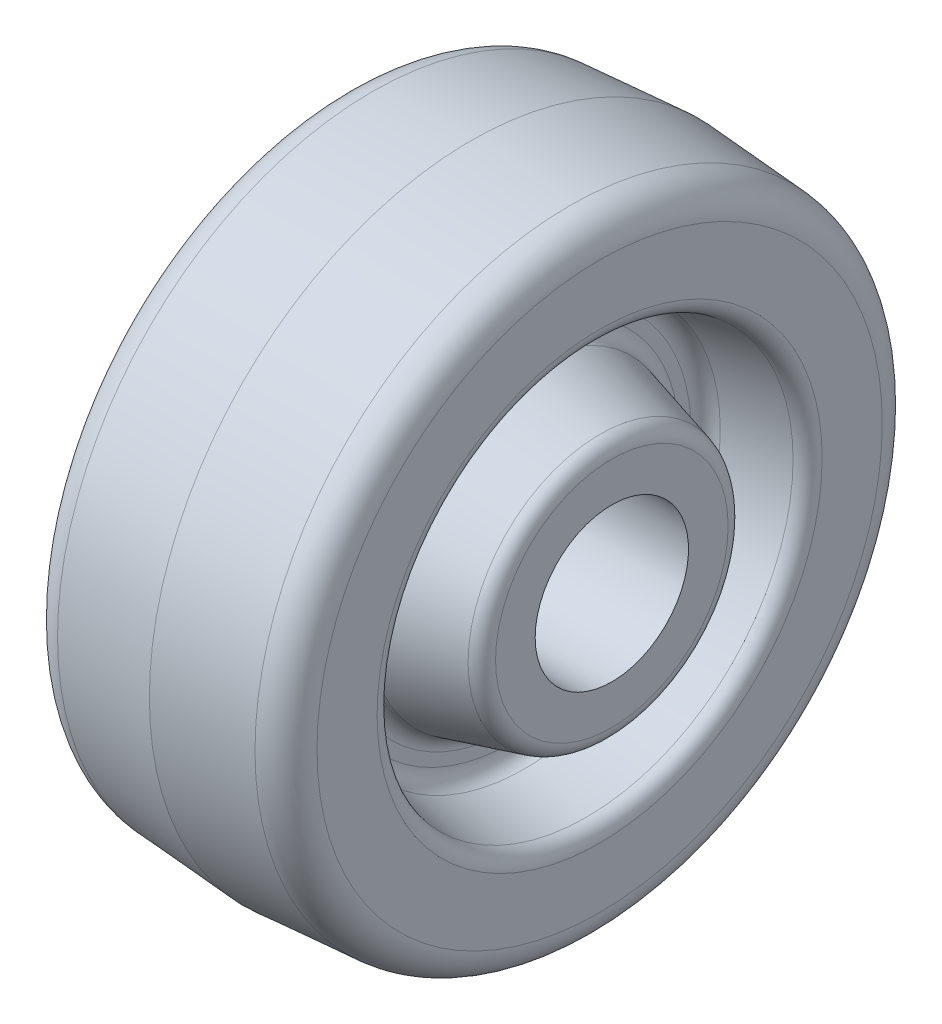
ISO-10303-21;
HEADER;
FILE_DESCRIPTION(('STEP AP214'),'2;1');
FILE_NAME('part.step','',(''),(''),'','','');
FILE_SCHEMA(('AUTOMOTIVE_DESIGN { 1 0 10303 214 1 1 1 1 }'));
ENDSEC;
DATA;
#1=APPLICATION_CONTEXT('core data for automotive mechanical design processes');
#2=APPLICATION_PROTOCOL_DEFINITION('international standard','automotive_design',2000,#1);
#3=PRODUCT_CONTEXT('',#1,'mechanical');
#4=PRODUCT('Part','Part','',(#3));
#5=PRODUCT_RELATED_PRODUCT_CATEGORY('part','',(#4));
#6=PRODUCT_DEFINITION_FORMATION('','',#4);
#7=PRODUCT_DEFINITION_CONTEXT('part definition',#1,'design');
#8=PRODUCT_DEFINITION('design','',#6,#7);
#9=PRODUCT_DEFINITION_SHAPE('','',#8);
#10=(LENGTH_UNIT() NAMED_UNIT(*) SI_UNIT(.MILLI.,.METRE.));
#11=(NAMED_UNIT(*) PLANE_ANGLE_UNIT() SI_UNIT($,.RADIAN.));
#12=(NAMED_UNIT(*) SI_UNIT($,.STERADIAN.) SOLID_ANGLE_UNIT());
#13=UNCERTAINTY_MEASURE_WITH_UNIT(LENGTH_MEASURE(1.E-05),#10,'distance_accuracy_value','');
#14=(GEOMETRIC_REPRESENTATION_CONTEXT(3) GLOBAL_UNCERTAINTY_ASSIGNED_CONTEXT((#13)) GLOBAL_UNIT_ASSIGNED_CONTEXT((#10,
#11,#12)) REPRESENTATION_CONTEXT('',''));
#15=CARTESIAN_POINT('',(0.,0.,0.));
#16=DIRECTION('',(0.,0.,1.));
#17=DIRECTION('',(1.,0.,0.));
#18=AXIS2_PLACEMENT_3D('',#15,#16,#17);
#19=CARTESIAN_POINT('',(0.,0.,0.));
#20=DIRECTION('',(1.,0.,0.));
#21=DIRECTION('',(0.,0.,-1.));
#22=AXIS2_PLACEMENT_3D('',#19,#20,#21);
#23=CONICAL_SURFACE('',#22,63.5,0.069813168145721);
#24=CARTESIAN_POINT('',(-19.4929535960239,0.,0.));
#25=DIRECTION('',(-1.,0.,0.));
#26=DIRECTION('',(0.,0.,1.));
#27=AXIS2_PLACEMENT_3D('',#24,#25,#26);
#28=CIRCLE('',#27,62.136919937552);
#29=CARTESIAN_POINT('',(-19.4929535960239,0.,62.136919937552));
#30=VERTEX_POINT('',#29);
#31=EDGE_CURVE('E433',#30,#30,#28,.T.);
#32=ORIENTED_EDGE('',*,*,#31,.F.);
#33=EDGE_LOOP('',(#32));
#34=FACE_BOUND('',#33,.T.);
#35=CARTESIAN_POINT('',(0.,0.,0.));
#36=DIRECTION('',(-1.,0.,0.));
#37=DIRECTION('',(0.,0.,1.));
#38=AXIS2_PLACEMENT_3D('',#35,#36,#37);
#39=CIRCLE('',#38,63.5);
#40=CARTESIAN_POINT('',(0.,0.,63.5));
#41=VERTEX_POINT('',#40);
#42=EDGE_CURVE('E10',#41,#41,#39,.T.);
#43=ORIENTED_EDGE('',*,*,#42,.T.);
#44=EDGE_LOOP('',(#43));
#45=FACE_BOUND('',#44,.T.);
#46=ADVANCED_FACE('F360',(#34,#45),#23,.T.);
#47=CARTESIAN_POINT('',(19.4929535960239,0.,0.));
#48=DIRECTION('',(-1.,0.,0.));
#49=DIRECTION('',(0.,0.,1.));
#50=AXIS2_PLACEMENT_3D('',#47,#48,#49);
#51=CONICAL_SURFACE('',#50,62.136919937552,0.0698131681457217);
#52=ORIENTED_EDGE('',*,*,#42,.F.);
#53=EDGE_LOOP('',(#52));
#54=FACE_BOUND('',#53,.T.);
#55=CARTESIAN_POINT('',(19.4929535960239,0.,0.));
#56=DIRECTION('',(-1.,0.,0.));
#57=DIRECTION('',(0.,0.,1.));
#58=AXIS2_PLACEMENT_3D('',#55,#56,#57);
#59=CIRCLE('',#58,62.136919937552);
#60=CARTESIAN_POINT('',(19.4929535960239,0.,62.136919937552));
#61=VERTEX_POINT('',#60);
#62=EDGE_CURVE('E366',#61,#61,#59,.T.);
#63=ORIENTED_EDGE('',*,*,#62,.T.);
#64=EDGE_LOOP('',(#63));
#65=FACE_BOUND('',#64,.T.);
#66=ADVANCED_FACE('F440',(#54,#65),#51,.T.);
#67=CARTESIAN_POINT('',(19.05,0.,0.));
#68=DIRECTION('',(-1.,0.,0.));
#69=DIRECTION('',(0.,0.,1.));
#70=AXIS2_PLACEMENT_3D('',#67,#68,#69);
#71=TOROIDAL_SURFACE('',#70,55.8023882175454,6.34999999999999);
#72=ORIENTED_EDGE('',*,*,#62,.F.);
#73=EDGE_LOOP('',(#72));
#74=FACE_BOUND('',#73,.T.);
#75=CARTESIAN_POINT('',(25.4,0.,0.));
#76=DIRECTION('',(-1.,0.,0.));
#77=DIRECTION('',(0.,0.,1.));
#78=AXIS2_PLACEMENT_3D('',#75,#76,#77);
#79=CIRCLE('',#78,55.8023882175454);
#80=CARTESIAN_POINT('',(25.4,0.,55.8023882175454));
#81=VERTEX_POINT('',#80);
#82=EDGE_CURVE('E370',#81,#81,#79,.T.);
#83=ORIENTED_EDGE('',*,*,#82,.T.);
#84=EDGE_LOOP('',(#83));
#85=FACE_BOUND('',#84,.T.);
#86=ADVANCED_FACE('F444',(#74,#85),#71,.T.);
#87=CARTESIAN_POINT('',(25.4,55.8023882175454,0.));
#88=DIRECTION('',(-1.,0.,0.));
#89=DIRECTION('',(0.,0.,1.));
#90=AXIS2_PLACEMENT_3D('',#87,#88,#89);
#91=PLANE('',#90);
#92=ORIENTED_EDGE('',*,*,#82,.F.);
#93=EDGE_LOOP('',(#92));
#94=FACE_BOUND('',#93,.T.);
#95=CARTESIAN_POINT('',(25.4,0.,0.));
#96=DIRECTION('',(-1.,0.,0.));
#97=DIRECTION('',(0.,0.,1.));
#98=AXIS2_PLACEMENT_3D('',#95,#96,#97);
#99=CIRCLE('',#98,43.9391413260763);
#100=CARTESIAN_POINT('',(25.4,0.,43.9391413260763));
#101=VERTEX_POINT('',#100);
#102=EDGE_CURVE('E374',#101,#101,#99,.T.);
#103=ORIENTED_EDGE('',*,*,#102,.T.);
#104=EDGE_LOOP('',(#103));
#105=FACE_BOUND('',#104,.T.);
#106=ADVANCED_FACE('F449',(#94,#105),#91,.F.);
#107=CARTESIAN_POINT('',(22.225,0.,0.));
#108=DIRECTION('',(-1.,0.,0.));
#109=DIRECTION('',(0.,0.,1.));
#110=AXIS2_PLACEMENT_3D('',#107,#108,#109);
#111=TOROIDAL_SURFACE('',#110,43.9391413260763,3.175);
#112=ORIENTED_EDGE('',*,*,#102,.F.);
#113=EDGE_LOOP('',(#112));
#114=FACE_BOUND('',#113,.T.);
#115=CARTESIAN_POINT('',(22.7763329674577,0.,0.));
#116=DIRECTION('',(-1.,0.,0.));
#117=DIRECTION('',(0.,0.,1.));
#118=AXIS2_PLACEMENT_3D('',#115,#116,#117);
#119=CIRCLE('',#118,40.812376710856);
#120=CARTESIAN_POINT('',(22.7763329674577,0.,40.812376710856));
#121=VERTEX_POINT('',#120);
#122=EDGE_CURVE('E379',#121,#121,#119,.T.);
#123=ORIENTED_EDGE('',*,*,#122,.T.);
#124=EDGE_LOOP('',(#123));
#125=FACE_BOUND('',#124,.T.);
#126=ADVANCED_FACE('F455',(#114,#125),#111,.T.);
#127=CARTESIAN_POINT('',(10.5611670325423,0.,0.));
#128=DIRECTION('',(1.,0.,0.));
#129=DIRECTION('',(0.,0.,-1.));
#130=AXIS2_PLACEMENT_3D('',#127,#128,#129);
#131=CONICAL_SURFACE('',#130,38.658513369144,0.174532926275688);
#132=ORIENTED_EDGE('',*,*,#122,.F.);
#133=EDGE_LOOP('',(#132));
#134=FACE_BOUND('',#133,.T.);
#135=CARTESIAN_POINT('',(10.5611670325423,0.,0.));
#136=DIRECTION('',(-1.,0.,0.));
#137=DIRECTION('',(0.,0.,1.));
#138=AXIS2_PLACEMENT_3D('',#135,#136,#137);
#139=CIRCLE('',#138,38.658513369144);
#140=CARTESIAN_POINT('',(10.5611670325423,0.,38.658513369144));
#141=VERTEX_POINT('',#140);
#142=EDGE_CURVE('E382',#141,#141,#139,.T.);
#143=ORIENTED_EDGE('',*,*,#142,.T.);
#144=EDGE_LOOP('',(#143));
#145=FACE_BOUND('',#144,.T.);
#146=ADVANCED_FACE('F459',(#134,#145),#131,.F.);
#147=CARTESIAN_POINT('',(11.1125,0.,0.));
#148=DIRECTION('',(-1.,0.,0.));
#149=DIRECTION('',(0.,0.,1.));
#150=AXIS2_PLACEMENT_3D('',#147,#148,#149);
#151=TOROIDAL_SURFACE('',#150,35.5317487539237,3.175);
#152=ORIENTED_EDGE('',*,*,#142,.F.);
#153=EDGE_LOOP('',(#152));
#154=FACE_BOUND('',#153,.T.);
#155=CARTESIAN_POINT('',(7.9375,0.,0.));
#156=DIRECTION('',(-1.,0.,0.));
#157=DIRECTION('',(0.,0.,1.));
#158=AXIS2_PLACEMENT_3D('',#155,#156,#157);
#159=CIRCLE('',#158,35.5317487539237);
#160=CARTESIAN_POINT('',(7.9375,0.,35.5317487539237));
#161=VERTEX_POINT('',#160);
#162=EDGE_CURVE('E385',#161,#161,#159,.T.);
#163=ORIENTED_EDGE('',*,*,#162,.T.);
#164=EDGE_LOOP('',(#163));
#165=FACE_BOUND('',#164,.T.);
#166=ADVANCED_FACE('F463',(#154,#165),#151,.F.);
#167=CARTESIAN_POINT('',(7.9375,35.5317487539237,0.));
#168=DIRECTION('',(-1.,0.,0.));
#169=DIRECTION('',(0.,0.,1.));
#170=AXIS2_PLACEMENT_3D('',#167,#168,#169);
#171=PLANE('',#170);
#172=ORIENTED_EDGE('',*,*,#162,.F.);
#173=EDGE_LOOP('',(#172));
#174=FACE_BOUND('',#173,.T.);
#175=CARTESIAN_POINT('',(7.9375,0.,0.));
#176=DIRECTION('',(-1.,0.,0.));
#177=DIRECTION('',(0.,0.,1.));
#178=AXIS2_PLACEMENT_3D('',#175,#176,#177);
#179=CIRCLE('',#178,33.1619720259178);
#180=CARTESIAN_POINT('',(7.9375,0.,33.1619720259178));
#181=VERTEX_POINT('',#180);
#182=EDGE_CURVE('E388',#181,#181,#179,.T.);
#183=ORIENTED_EDGE('',*,*,#182,.T.);
#184=EDGE_LOOP('',(#183));
#185=FACE_BOUND('',#184,.T.);
#186=ADVANCED_FACE('F467',(#174,#185),#171,.F.);
#187=CARTESIAN_POINT('',(11.1125,0.,0.));
#188=DIRECTION('',(-1.,0.,0.));
#189=DIRECTION('',(0.,0.,1.));
#190=AXIS2_PLACEMENT_3D('',#187,#188,#189);
#191=TOROIDAL_SURFACE('',#190,33.1619720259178,3.175);
#192=ORIENTED_EDGE('',*,*,#182,.F.);
#193=EDGE_LOOP('',(#192));
#194=FACE_BOUND('',#193,.T.);
#195=CARTESIAN_POINT('',(10.2907357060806,0.,0.));
#196=DIRECTION('',(-1.,0.,0.));
#197=DIRECTION('',(0.,0.,1.));
#198=AXIS2_PLACEMENT_3D('',#195,#196,#197);
#199=CIRCLE('',#198,30.0951612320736);
#200=CARTESIAN_POINT('',(10.2907357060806,0.,30.0951612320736));
#201=VERTEX_POINT('',#200);
#202=EDGE_CURVE('E391',#201,#201,#199,.T.);
#203=ORIENTED_EDGE('',*,*,#202,.T.);
#204=EDGE_LOOP('',(#203));
#205=FACE_BOUND('',#204,.T.);
#206=ADVANCED_FACE('F471',(#194,#205),#191,.F.);
#207=CARTESIAN_POINT('',(25.4597642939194,0.,0.));
#208=DIRECTION('',(-1.,0.,0.));
#209=DIRECTION('',(0.,0.,1.));
#210=AXIS2_PLACEMENT_3D('',#207,#208,#209);
#211=CONICAL_SURFACE('',#210,26.0305589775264,0.261803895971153);
#212=ORIENTED_EDGE('',*,*,#202,.F.);
#213=EDGE_LOOP('',(#212));
#214=FACE_BOUND('',#213,.T.);
#215=CARTESIAN_POINT('',(25.4597642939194,0.,0.));
#216=DIRECTION('',(-1.,0.,0.));
#217=DIRECTION('',(0.,0.,1.));
#218=AXIS2_PLACEMENT_3D('',#215,#216,#217);
#219=CIRCLE('',#218,26.0305589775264);
#220=CARTESIAN_POINT('',(25.4597642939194,0.,26.0305589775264));
#221=VERTEX_POINT('',#220);
#222=EDGE_CURVE('E394',#221,#221,#219,.T.);
#223=ORIENTED_EDGE('',*,*,#222,.T.);
#224=EDGE_LOOP('',(#223));
#225=FACE_BOUND('',#224,.T.);
#226=ADVANCED_FACE('F475',(#214,#225),#211,.T.);
#227=CARTESIAN_POINT('',(24.638,0.,0.));
#228=DIRECTION('',(-1.,0.,0.));
#229=DIRECTION('',(0.,0.,1.));
#230=AXIS2_PLACEMENT_3D('',#227,#228,#229);
#231=TOROIDAL_SURFACE('',#230,22.9637481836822,3.175);
#232=ORIENTED_EDGE('',*,*,#222,.F.);
#233=EDGE_LOOP('',(#232));
#234=FACE_BOUND('',#233,.T.);
#235=CARTESIAN_POINT('',(27.813,0.,0.));
#236=DIRECTION('',(-1.,0.,0.));
#237=DIRECTION('',(0.,0.,1.));
#238=AXIS2_PLACEMENT_3D('',#235,#236,#237);
#239=CIRCLE('',#238,22.9637481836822);
#240=CARTESIAN_POINT('',(27.813,0.,22.9637481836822));
#241=VERTEX_POINT('',#240);
#242=EDGE_CURVE('E397',#241,#241,#239,.T.);
#243=ORIENTED_EDGE('',*,*,#242,.T.);
#244=EDGE_LOOP('',(#243));
#245=FACE_BOUND('',#244,.T.);
#246=ADVANCED_FACE('F479',(#234,#245),#231,.T.);
#247=CARTESIAN_POINT('',(27.813,22.9637481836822,0.));
#248=DIRECTION('',(-1.,0.,0.));
#249=DIRECTION('',(0.,0.,1.));
#250=AXIS2_PLACEMENT_3D('',#247,#248,#249);
#251=PLANE('',#250);
#252=ORIENTED_EDGE('',*,*,#242,.F.);
#253=EDGE_LOOP('',(#252));
#254=FACE_BOUND('',#253,.T.);
#255=CARTESIAN_POINT('',(27.813,0.,0.));
#256=DIRECTION('',(-1.,0.,0.));
#257=DIRECTION('',(0.,0.,1.));
#258=AXIS2_PLACEMENT_3D('',#255,#256,#257);
#259=CIRCLE('',#258,15.1384);
#260=CARTESIAN_POINT('',(27.813,0.,15.1384));
#261=VERTEX_POINT('',#260);
#262=EDGE_CURVE('E400',#261,#261,#259,.T.);
#263=ORIENTED_EDGE('',*,*,#262,.T.);
#264=EDGE_LOOP('',(#263));
#265=FACE_BOUND('',#264,.T.);
#266=ADVANCED_FACE('F483',(#254,#265),#251,.F.);
#267=CARTESIAN_POINT('',(-38.862204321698,0.,0.));
#268=DIRECTION('',(-1.,0.,0.));
#269=DIRECTION('',(0.,0.,1.));
#270=AXIS2_PLACEMENT_3D('',#267,#268,#269);
#271=CYLINDRICAL_SURFACE('',#270,15.1384);
#272=ORIENTED_EDGE('',*,*,#262,.F.);
#273=EDGE_LOOP('',(#272));
#274=FACE_BOUND('',#273,.T.);
#275=CARTESIAN_POINT('',(-27.813,0.,0.));
#276=DIRECTION('',(-1.,0.,0.));
#277=DIRECTION('',(0.,0.,1.));
#278=AXIS2_PLACEMENT_3D('',#275,#276,#277);
#279=CIRCLE('',#278,15.1384);
#280=CARTESIAN_POINT('',(-27.813,0.,15.1384));
#281=VERTEX_POINT('',#280);
#282=EDGE_CURVE('E403',#281,#281,#279,.T.);
#283=ORIENTED_EDGE('',*,*,#282,.T.);
#284=EDGE_LOOP('',(#283));
#285=FACE_BOUND('',#284,.T.);
#286=ADVANCED_FACE('F487',(#274,#285),#271,.F.);
#287=CARTESIAN_POINT('',(-27.813,15.1384,0.));
#288=DIRECTION('',(1.,0.,0.));
#289=DIRECTION('',(0.,0.,-1.));
#290=AXIS2_PLACEMENT_3D('',#287,#288,#289);
#291=PLANE('',#290);
#292=ORIENTED_EDGE('',*,*,#282,.F.);
#293=EDGE_LOOP('',(#292));
#294=FACE_BOUND('',#293,.T.);
#295=CARTESIAN_POINT('',(-27.813,0.,0.));
#296=DIRECTION('',(-1.,0.,0.));
#297=DIRECTION('',(0.,0.,1.));
#298=AXIS2_PLACEMENT_3D('',#295,#296,#297);
#299=CIRCLE('',#298,22.9637481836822);
#300=CARTESIAN_POINT('',(-27.813,0.,22.9637481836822));
#301=VERTEX_POINT('',#300);
#302=EDGE_CURVE('E406',#301,#301,#299,.T.);
#303=ORIENTED_EDGE('',*,*,#302,.T.);
#304=EDGE_LOOP('',(#303));
#305=FACE_BOUND('',#304,.T.);
#306=ADVANCED_FACE('F491',(#294,#305),#291,.F.);
#307=CARTESIAN_POINT('',(-24.638,0.,0.));
#308=DIRECTION('',(-1.,0.,0.));
#309=DIRECTION('',(0.,0.,1.));
#310=AXIS2_PLACEMENT_3D('',#307,#308,#309);
#311=TOROIDAL_SURFACE('',#310,22.9637481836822,3.175);
#312=ORIENTED_EDGE('',*,*,#302,.F.);
#313=EDGE_LOOP('',(#312));
#314=FACE_BOUND('',#313,.T.);
#315=CARTESIAN_POINT('',(-25.4597642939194,0.,0.));
#316=DIRECTION('',(-1.,0.,0.));
#317=DIRECTION('',(0.,0.,1.));
#318=AXIS2_PLACEMENT_3D('',#315,#316,#317);
#319=CIRCLE('',#318,26.0305589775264);
#320=CARTESIAN_POINT('',(-25.4597642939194,0.,26.0305589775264));
#321=VERTEX_POINT('',#320);
#322=EDGE_CURVE('E409',#321,#321,#319,.T.);
#323=ORIENTED_EDGE('',*,*,#322,.T.);
#324=EDGE_LOOP('',(#323));
#325=FACE_BOUND('',#324,.T.);
#326=ADVANCED_FACE('F495',(#314,#325),#311,.T.);
#327=CARTESIAN_POINT('',(-10.2907357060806,0.,0.));
#328=DIRECTION('',(1.,0.,0.));
#329=DIRECTION('',(0.,0.,-1.));
#330=AXIS2_PLACEMENT_3D('',#327,#328,#329);
#331=CONICAL_SURFACE('',#330,30.0951612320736,0.261803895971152);
#332=ORIENTED_EDGE('',*,*,#322,.F.);
#333=EDGE_LOOP('',(#332));
#334=FACE_BOUND('',#333,.T.);
#335=CARTESIAN_POINT('',(-10.2907357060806,0.,0.));
#336=DIRECTION('',(-1.,0.,0.));
#337=DIRECTION('',(0.,0.,1.));
#338=AXIS2_PLACEMENT_3D('',#335,#336,#337);
#339=CIRCLE('',#338,30.0951612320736);
#340=CARTESIAN_POINT('',(-10.2907357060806,0.,30.0951612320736));
#341=VERTEX_POINT('',#340);
#342=EDGE_CURVE('E412',#341,#341,#339,.T.);
#343=ORIENTED_EDGE('',*,*,#342,.T.);
#344=EDGE_LOOP('',(#343));
#345=FACE_BOUND('',#344,.T.);
#346=ADVANCED_FACE('F499',(#334,#345),#331,.T.);
#347=CARTESIAN_POINT('',(-11.1125,0.,0.));
#348=DIRECTION('',(-1.,0.,0.));
#349=DIRECTION('',(0.,0.,1.));
#350=AXIS2_PLACEMENT_3D('',#347,#348,#349);
#351=TOROIDAL_SURFACE('',#350,33.1619720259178,3.175);
#352=ORIENTED_EDGE('',*,*,#342,.F.);
#353=EDGE_LOOP('',(#352));
#354=FACE_BOUND('',#353,.T.);
#355=CARTESIAN_POINT('',(-7.9375,0.,0.));
#356=DIRECTION('',(-1.,0.,0.));
#357=DIRECTION('',(0.,0.,1.));
#358=AXIS2_PLACEMENT_3D('',#355,#356,#357);
#359=CIRCLE('',#358,33.1619720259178);
#360=CARTESIAN_POINT('',(-7.9375,0.,33.1619720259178));
#361=VERTEX_POINT('',#360);
#362=EDGE_CURVE('E415',#361,#361,#359,.T.);
#363=ORIENTED_EDGE('',*,*,#362,.T.);
#364=EDGE_LOOP('',(#363));
#365=FACE_BOUND('',#364,.T.);
#366=ADVANCED_FACE('F503',(#354,#365),#351,.F.);
#367=CARTESIAN_POINT('',(-7.9375,33.1619720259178,0.));
#368=DIRECTION('',(1.,0.,0.));
#369=DIRECTION('',(0.,0.,-1.));
#370=AXIS2_PLACEMENT_3D('',#367,#368,#369);
#371=PLANE('',#370);
#372=ORIENTED_EDGE('',*,*,#362,.F.);
#373=EDGE_LOOP('',(#372));
#374=FACE_BOUND('',#373,.T.);
#375=CARTESIAN_POINT('',(-7.9375,0.,0.));
#376=DIRECTION('',(-1.,0.,0.));
#377=DIRECTION('',(0.,0.,1.));
#378=AXIS2_PLACEMENT_3D('',#375,#376,#377);
#379=CIRCLE('',#378,35.5317487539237);
#380=CARTESIAN_POINT('',(-7.9375,0.,35.5317487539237));
#381=VERTEX_POINT('',#380);
#382=EDGE_CURVE('E418',#381,#381,#379,.T.);
#383=ORIENTED_EDGE('',*,*,#382,.T.);
#384=EDGE_LOOP('',(#383));
#385=FACE_BOUND('',#384,.T.);
#386=ADVANCED_FACE('F507',(#374,#385),#371,.F.);
#387=CARTESIAN_POINT('',(-11.1125,0.,0.));
#388=DIRECTION('',(-1.,0.,0.));
#389=DIRECTION('',(0.,0.,1.));
#390=AXIS2_PLACEMENT_3D('',#387,#388,#389);
#391=TOROIDAL_SURFACE('',#390,35.5317487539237,3.175);
#392=ORIENTED_EDGE('',*,*,#382,.F.);
#393=EDGE_LOOP('',(#392));
#394=FACE_BOUND('',#393,.T.);
#395=CARTESIAN_POINT('',(-10.5611670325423,0.,0.));
#396=DIRECTION('',(-1.,0.,0.));
#397=DIRECTION('',(0.,0.,1.));
#398=AXIS2_PLACEMENT_3D('',#395,#396,#397);
#399=CIRCLE('',#398,38.658513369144);
#400=CARTESIAN_POINT('',(-10.5611670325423,0.,38.658513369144));
#401=VERTEX_POINT('',#400);
#402=EDGE_CURVE('E421',#401,#401,#399,.T.);
#403=ORIENTED_EDGE('',*,*,#402,.T.);
#404=EDGE_LOOP('',(#403));
#405=FACE_BOUND('',#404,.T.);
#406=ADVANCED_FACE('F511',(#394,#405),#391,.F.);
#407=CARTESIAN_POINT('',(-22.7763329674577,0.,0.));
#408=DIRECTION('',(-1.,0.,0.));
#409=DIRECTION('',(0.,0.,1.));
#410=AXIS2_PLACEMENT_3D('',#407,#408,#409);
#411=CONICAL_SURFACE('',#410,40.812376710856,0.174532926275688);
#412=ORIENTED_EDGE('',*,*,#402,.F.);
#413=EDGE_LOOP('',(#412));
#414=FACE_BOUND('',#413,.T.);
#415=CARTESIAN_POINT('',(-22.7763329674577,0.,0.));
#416=DIRECTION('',(-1.,0.,0.));
#417=DIRECTION('',(0.,0.,1.));
#418=AXIS2_PLACEMENT_3D('',#415,#416,#417);
#419=CIRCLE('',#418,40.812376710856);
#420=CARTESIAN_POINT('',(-22.7763329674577,0.,40.812376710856));
#421=VERTEX_POINT('',#420);
#422=EDGE_CURVE('E424',#421,#421,#419,.T.);
#423=ORIENTED_EDGE('',*,*,#422,.T.);
#424=EDGE_LOOP('',(#423));
#425=FACE_BOUND('',#424,.T.);
#426=ADVANCED_FACE('F515',(#414,#425),#411,.F.);
#427=CARTESIAN_POINT('',(-22.225,0.,0.));
#428=DIRECTION('',(-1.,0.,0.));
#429=DIRECTION('',(0.,0.,1.));
#430=AXIS2_PLACEMENT_3D('',#427,#428,#429);
#431=TOROIDAL_SURFACE('',#430,43.9391413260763,3.175);
#432=ORIENTED_EDGE('',*,*,#422,.F.);
#433=EDGE_LOOP('',(#432));
#434=FACE_BOUND('',#433,.T.);
#435=CARTESIAN_POINT('',(-25.4,0.,0.));
#436=DIRECTION('',(-1.,0.,0.));
#437=DIRECTION('',(0.,0.,1.));
#438=AXIS2_PLACEMENT_3D('',#435,#436,#437);
#439=CIRCLE('',#438,43.9391413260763);
#440=CARTESIAN_POINT('',(-25.4,0.,43.9391413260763));
#441=VERTEX_POINT('',#440);
#442=EDGE_CURVE('E427',#441,#441,#439,.T.);
#443=ORIENTED_EDGE('',*,*,#442,.T.);
#444=EDGE_LOOP('',(#443));
#445=FACE_BOUND('',#444,.T.);
#446=ADVANCED_FACE('F519',(#434,#445),#431,.T.);
#447=CARTESIAN_POINT('',(-25.4,43.9391413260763,0.));
#448=DIRECTION('',(1.,0.,0.));
#449=DIRECTION('',(0.,0.,-1.));
#450=AXIS2_PLACEMENT_3D('',#447,#448,#449);
#451=PLANE('',#450);
#452=ORIENTED_EDGE('',*,*,#442,.F.);
#453=EDGE_LOOP('',(#452));
#454=FACE_BOUND('',#453,.T.);
#455=CARTESIAN_POINT('',(-25.4,0.,0.));
#456=DIRECTION('',(-1.,0.,0.));
#457=DIRECTION('',(0.,0.,1.));
#458=AXIS2_PLACEMENT_3D('',#455,#456,#457);
#459=CIRCLE('',#458,55.8023882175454);
#460=CARTESIAN_POINT('',(-25.4,0.,55.8023882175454));
#461=VERTEX_POINT('',#460);
#462=EDGE_CURVE('E430',#461,#461,#459,.T.);
#463=ORIENTED_EDGE('',*,*,#462,.T.);
#464=EDGE_LOOP('',(#463));
#465=FACE_BOUND('',#464,.T.);
#466=ADVANCED_FACE('F523',(#454,#465),#451,.F.);
#467=CARTESIAN_POINT('',(-19.05,0.,0.));
#468=DIRECTION('',(-1.,0.,0.));
#469=DIRECTION('',(0.,0.,1.));
#470=AXIS2_PLACEMENT_3D('',#467,#468,#469);
#471=TOROIDAL_SURFACE('',#470,55.8023882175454,6.34999999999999);
#472=ORIENTED_EDGE('',*,*,#462,.F.);
#473=EDGE_LOOP('',(#472));
#474=FACE_BOUND('',#473,.T.);
#475=ORIENTED_EDGE('',*,*,#31,.T.);
#476=EDGE_LOOP('',(#475));
#477=FACE_BOUND('',#476,.T.);
#478=ADVANCED_FACE('F437',(#474,#477),#471,.T.);
#479=CLOSED_SHELL('',(#46,#66,#86,#106,#126,#146,#166,#186,#206,#226,#246,#266,#286,#306,#326,
#346,#366,#386,#406,#426,#446,#466,#478));
#480=MANIFOLD_SOLID_BREP('B2',#479);
#481=ADVANCED_BREP_SHAPE_REPRESENTATION('',(#18,#480),#14);
#482=SHAPE_DEFINITION_REPRESENTATION(#9,#481);
ENDSEC;
END-ISO-10303-21;
